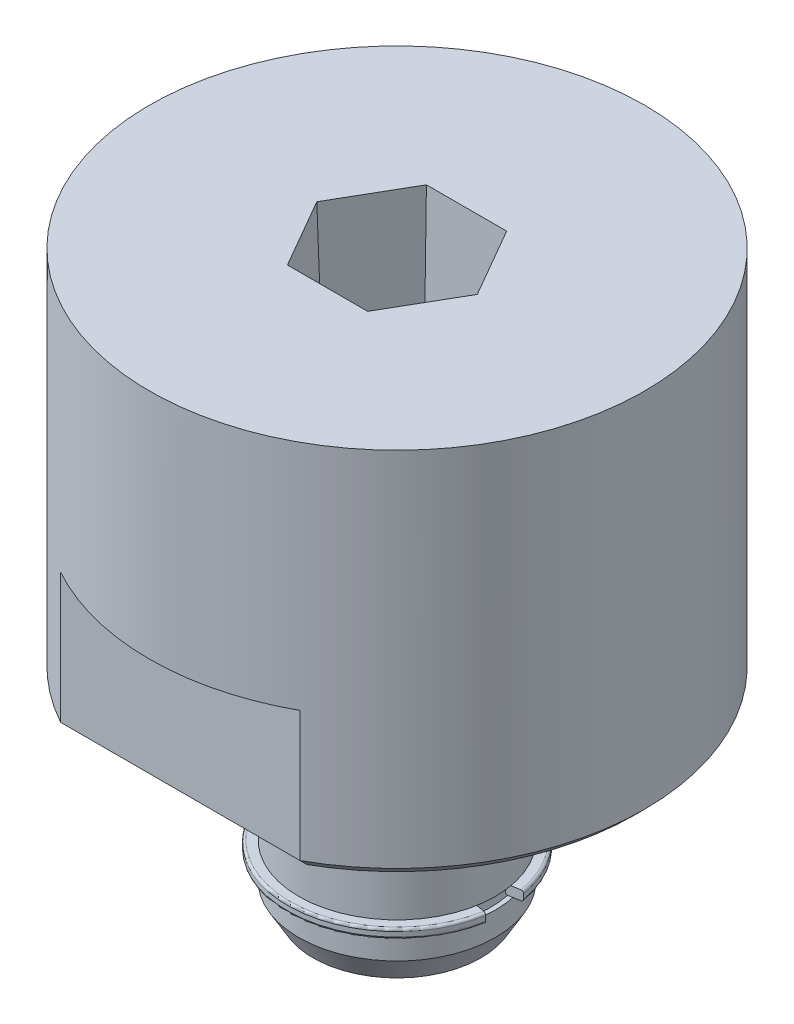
ISO-10303-21;
HEADER;
FILE_DESCRIPTION(('STEP AP214'),'2;1');
FILE_NAME('part.step','',(''),(''),'','','');
FILE_SCHEMA(('AUTOMOTIVE_DESIGN { 1 0 10303 214 1 1 1 1 }'));
ENDSEC;
DATA;
#1=APPLICATION_CONTEXT('core data for automotive mechanical design processes');
#2=APPLICATION_PROTOCOL_DEFINITION('international standard','automotive_design',2000,#1);
#3=PRODUCT_CONTEXT('',#1,'mechanical');
#4=PRODUCT('Part','Part','',(#3));
#5=PRODUCT_RELATED_PRODUCT_CATEGORY('part','',(#4));
#6=PRODUCT_DEFINITION_FORMATION('','',#4);
#7=PRODUCT_DEFINITION_CONTEXT('part definition',#1,'design');
#8=PRODUCT_DEFINITION('design','',#6,#7);
#9=PRODUCT_DEFINITION_SHAPE('','',#8);
#10=(LENGTH_UNIT() NAMED_UNIT(*) SI_UNIT(.MILLI.,.METRE.));
#11=(NAMED_UNIT(*) PLANE_ANGLE_UNIT() SI_UNIT($,.RADIAN.));
#12=(NAMED_UNIT(*) SI_UNIT($,.STERADIAN.) SOLID_ANGLE_UNIT());
#13=UNCERTAINTY_MEASURE_WITH_UNIT(LENGTH_MEASURE(1.E-05),#10,'distance_accuracy_value','');
#14=(GEOMETRIC_REPRESENTATION_CONTEXT(3) GLOBAL_UNCERTAINTY_ASSIGNED_CONTEXT((#13)) GLOBAL_UNIT_ASSIGNED_CONTEXT((#10,
#11,#12)) REPRESENTATION_CONTEXT('',''));
#15=CARTESIAN_POINT('',(0.,0.,0.));
#16=DIRECTION('',(0.,0.,1.));
#17=DIRECTION('',(1.,0.,0.));
#18=AXIS2_PLACEMENT_3D('',#15,#16,#17);
#19=CARTESIAN_POINT('',(0.,0.527599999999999,0.));
#20=DIRECTION('',(0.,-1.,0.));
#21=DIRECTION('',(0.,0.,-1.));
#22=AXIS2_PLACEMENT_3D('',#19,#20,#21);
#23=CYLINDRICAL_SURFACE('',#22,3.0226);
#24=CARTESIAN_POINT('',(0.,1.7214,0.));
#25=DIRECTION('',(0.,-1.,0.));
#26=DIRECTION('',(0.984807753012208,0.,0.17364817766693));
#27=AXIS2_PLACEMENT_3D('',#24,#25,#26);
#28=CIRCLE('',#27,3.0226);
#29=CARTESIAN_POINT('',(2.9766799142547,1.7214,0.524868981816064));
#30=VERTEX_POINT('',#29);
#31=CARTESIAN_POINT('',(2.9766799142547,1.7214,-0.524868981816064));
#32=VERTEX_POINT('',#31);
#33=EDGE_CURVE('E125',#30,#32,#28,.T.);
#34=ORIENTED_EDGE('',*,*,#33,.T.);
#35=DIRECTION('',(0.,1.,0.));
#36=VECTOR('',#35,1.);
#37=CARTESIAN_POINT('',(2.9766799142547,1.7214,-0.524868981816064));
#38=LINE('',#37,#36);
#39=CARTESIAN_POINT('',(2.9766799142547,1.8738,-0.524868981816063));
#40=VERTEX_POINT('',#39);
#41=EDGE_CURVE('E116',#32,#40,#38,.T.);
#42=ORIENTED_EDGE('',*,*,#41,.T.);
#43=CARTESIAN_POINT('',(0.,1.8738,0.));
#44=DIRECTION('',(0.,-1.,0.));
#45=DIRECTION('',(0.984807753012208,0.,0.17364817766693));
#46=AXIS2_PLACEMENT_3D('',#43,#44,#45);
#47=CIRCLE('',#46,3.0226);
#48=CARTESIAN_POINT('',(2.9766799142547,1.8738,0.524868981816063));
#49=VERTEX_POINT('',#48);
#50=EDGE_CURVE('E124',#49,#40,#47,.T.);
#51=ORIENTED_EDGE('',*,*,#50,.F.);
#52=DIRECTION('',(0.,-1.,0.));
#53=VECTOR('',#52,1.);
#54=CARTESIAN_POINT('',(2.9766799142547,1.8738,0.524868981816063));
#55=LINE('',#54,#53);
#56=EDGE_CURVE('E137',#49,#30,#55,.T.);
#57=ORIENTED_EDGE('',*,*,#56,.T.);
#58=EDGE_LOOP('',(#34,#42,#51,#57));
#59=FACE_BOUND('',#58,.T.);
#60=ADVANCED_FACE('F54',(#59),#23,.F.);
#61=CARTESIAN_POINT('',(0.,1.72139999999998,0.));
#62=DIRECTION('',(0.,-1.,0.));
#63=DIRECTION('',(0.,0.,-1.));
#64=AXIS2_PLACEMENT_3D('',#61,#62,#63);
#65=TOROIDAL_SURFACE('',#64,3.0988,0.0761999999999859);
#66=CARTESIAN_POINT('',(0.,1.6452,0.));
#67=DIRECTION('',(0.,-1.,0.));
#68=DIRECTION('',(0.984807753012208,0.,0.173648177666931));
#69=AXIS2_PLACEMENT_3D('',#66,#67,#68);
#70=CIRCLE('',#69,3.0988);
#71=CARTESIAN_POINT('',(3.05172226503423,1.6452,0.538100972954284));
#72=VERTEX_POINT('',#71);
#73=CARTESIAN_POINT('',(3.05172226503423,1.6452,-0.538100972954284));
#74=VERTEX_POINT('',#73);
#75=EDGE_CURVE('E133',#72,#74,#70,.T.);
#76=ORIENTED_EDGE('',*,*,#75,.T.);
#77=CARTESIAN_POINT('',(3.05172226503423,1.72139999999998,-0.538100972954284));
#78=DIRECTION('',(-0.17364817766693,0.,-0.984807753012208));
#79=DIRECTION('',(0.,-1.,0.));
#80=AXIS2_PLACEMENT_3D('',#77,#78,#79);
#81=CIRCLE('',#80,0.0761999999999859);
#82=EDGE_CURVE('E118',#74,#32,#81,.T.);
#83=ORIENTED_EDGE('',*,*,#82,.T.);
#84=ORIENTED_EDGE('',*,*,#33,.F.);
#85=CARTESIAN_POINT('',(3.05172226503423,1.72139999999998,0.538100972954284));
#86=DIRECTION('',(-0.17364817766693,0.,0.984807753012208));
#87=DIRECTION('',(-0.984807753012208,0.,-0.17364817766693));
#88=AXIS2_PLACEMENT_3D('',#85,#86,#87);
#89=CIRCLE('',#88,0.0761999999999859);
#90=EDGE_CURVE('E134',#30,#72,#89,.T.);
#91=ORIENTED_EDGE('',*,*,#90,.T.);
#92=EDGE_LOOP('',(#76,#83,#84,#91));
#93=FACE_BOUND('',#92,.T.);
#94=ADVANCED_FACE('F130',(#93),#65,.T.);
#95=CARTESIAN_POINT('',(3.0988,1.6452,0.));
#96=DIRECTION('',(0.,-1.,0.));
#97=DIRECTION('',(0.,0.,-1.));
#98=AXIS2_PLACEMENT_3D('',#95,#96,#97);
#99=PLANE('',#98);
#100=CARTESIAN_POINT('',(0.,1.6452,0.));
#101=DIRECTION('',(0.,-1.,0.));
#102=DIRECTION('',(0.984807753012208,0.,0.17364817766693));
#103=AXIS2_PLACEMENT_3D('',#100,#101,#102);
#104=CIRCLE('',#103,3.45439999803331);
#105=CARTESIAN_POINT('',(3.40191990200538,1.6452,0.599850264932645));
#106=VERTEX_POINT('',#105);
#107=CARTESIAN_POINT('',(3.40191990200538,1.6452,-0.599850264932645));
#108=VERTEX_POINT('',#107);
#109=EDGE_CURVE('E156',#106,#108,#104,.T.);
#110=ORIENTED_EDGE('',*,*,#109,.T.);
#111=DIRECTION('',(-0.984807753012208,0.,0.17364817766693));
#112=VECTOR('',#111,1.);
#113=CARTESIAN_POINT('',(3.40191990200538,1.6452,-0.599850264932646));
#114=LINE('',#113,#112);
#115=EDGE_CURVE('E161',#108,#74,#114,.T.);
#116=ORIENTED_EDGE('',*,*,#115,.T.);
#117=ORIENTED_EDGE('',*,*,#75,.F.);
#118=DIRECTION('',(0.984807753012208,0.,0.17364817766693));
#119=VECTOR('',#118,1.);
#120=CARTESIAN_POINT('',(3.05172226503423,1.6452,0.538100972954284));
#121=LINE('',#120,#119);
#122=EDGE_CURVE('E165',#72,#106,#121,.T.);
#123=ORIENTED_EDGE('',*,*,#122,.T.);
#124=EDGE_LOOP('',(#110,#116,#117,#123));
#125=FACE_BOUND('',#124,.T.);
#126=ADVANCED_FACE('F248',(#125),#99,.T.);
#127=CARTESIAN_POINT('',(0.,1.72139999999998,0.));
#128=DIRECTION('',(0.,-1.,0.));
#129=DIRECTION('',(0.,0.,-1.));
#130=AXIS2_PLACEMENT_3D('',#127,#128,#129);
#131=TOROIDAL_SURFACE('',#130,3.4544,0.0761999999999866);
#132=CARTESIAN_POINT('',(0.,1.7214,0.));
#133=DIRECTION('',(0.,-1.,0.));
#134=DIRECTION('',(0.984807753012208,0.,0.17364817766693));
#135=AXIS2_PLACEMENT_3D('',#132,#133,#134);
#136=CIRCLE('',#135,3.5306);
#137=CARTESIAN_POINT('',(3.4769622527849,1.7214,0.613082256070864));
#138=VERTEX_POINT('',#137);
#139=CARTESIAN_POINT('',(3.4769622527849,1.7214,-0.613082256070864));
#140=VERTEX_POINT('',#139);
#141=EDGE_CURVE('E170',#138,#140,#136,.T.);
#142=ORIENTED_EDGE('',*,*,#141,.T.);
#143=CARTESIAN_POINT('',(3.40191990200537,1.72139999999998,-0.599850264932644));
#144=DIRECTION('',(-0.17364817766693,0.,-0.984807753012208));
#145=DIRECTION('',(0.984807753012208,0.,-0.17364817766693));
#146=AXIS2_PLACEMENT_3D('',#143,#144,#145);
#147=CIRCLE('',#146,0.0761999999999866);
#148=EDGE_CURVE('E175',#140,#108,#147,.T.);
#149=ORIENTED_EDGE('',*,*,#148,.T.);
#150=ORIENTED_EDGE('',*,*,#109,.F.);
#151=CARTESIAN_POINT('',(3.40191990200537,1.72139999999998,0.599850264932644));
#152=DIRECTION('',(-0.17364817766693,0.,0.984807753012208));
#153=DIRECTION('',(1.10880188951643E-13,-1.,0.));
#154=AXIS2_PLACEMENT_3D('',#151,#152,#153);
#155=CIRCLE('',#154,0.0761999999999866);
#156=EDGE_CURVE('E180',#106,#138,#155,.T.);
#157=ORIENTED_EDGE('',*,*,#156,.T.);
#158=EDGE_LOOP('',(#142,#149,#150,#157));
#159=FACE_BOUND('',#158,.T.);
#160=ADVANCED_FACE('F246',(#159),#131,.T.);
#161=CARTESIAN_POINT('',(0.,0.527599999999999,0.));
#162=DIRECTION('',(0.,-1.,0.));
#163=DIRECTION('',(0.,0.,-1.));
#164=AXIS2_PLACEMENT_3D('',#161,#162,#163);
#165=CYLINDRICAL_SURFACE('',#164,3.5306);
#166=CARTESIAN_POINT('',(0.,1.8738,0.));
#167=DIRECTION('',(0.,-1.,0.));
#168=DIRECTION('',(0.984807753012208,0.,0.17364817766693));
#169=AXIS2_PLACEMENT_3D('',#166,#167,#168);
#170=CIRCLE('',#169,3.5306);
#171=CARTESIAN_POINT('',(3.4769622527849,1.8738,0.613082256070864));
#172=VERTEX_POINT('',#171);
#173=CARTESIAN_POINT('',(3.4769622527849,1.8738,-0.613082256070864));
#174=VERTEX_POINT('',#173);
#175=EDGE_CURVE('E185',#172,#174,#170,.T.);
#176=ORIENTED_EDGE('',*,*,#175,.T.);
#177=DIRECTION('',(0.,-1.,0.));
#178=VECTOR('',#177,1.);
#179=CARTESIAN_POINT('',(3.4769622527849,1.8738,-0.613082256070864));
#180=LINE('',#179,#178);
#181=EDGE_CURVE('E190',#174,#140,#180,.T.);
#182=ORIENTED_EDGE('',*,*,#181,.T.);
#183=ORIENTED_EDGE('',*,*,#141,.F.);
#184=DIRECTION('',(0.,1.,0.));
#185=VECTOR('',#184,1.);
#186=CARTESIAN_POINT('',(3.4769622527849,1.7214,0.613082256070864));
#187=LINE('',#186,#185);
#188=EDGE_CURVE('E195',#138,#172,#187,.T.);
#189=ORIENTED_EDGE('',*,*,#188,.T.);
#190=EDGE_LOOP('',(#176,#182,#183,#189));
#191=FACE_BOUND('',#190,.T.);
#192=ADVANCED_FACE('F242',(#191),#165,.T.);
#193=CARTESIAN_POINT('',(0.,1.87380000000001,0.));
#194=DIRECTION('',(0.,-1.,0.));
#195=DIRECTION('',(0.,0.,-1.));
#196=AXIS2_PLACEMENT_3D('',#193,#194,#195);
#197=TOROIDAL_SURFACE('',#196,3.4544,0.0761999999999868);
#198=CARTESIAN_POINT('',(0.,1.95,0.));
#199=DIRECTION('',(0.,-1.,0.));
#200=DIRECTION('',(0.984807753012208,0.,0.17364817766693));
#201=AXIS2_PLACEMENT_3D('',#198,#199,#200);
#202=CIRCLE('',#201,3.45439999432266);
#203=CARTESIAN_POINT('',(3.40191990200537,1.95,0.599850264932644));
#204=VERTEX_POINT('',#203);
#205=CARTESIAN_POINT('',(3.40191990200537,1.95,-0.599850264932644));
#206=VERTEX_POINT('',#205);
#207=EDGE_CURVE('E200',#204,#206,#202,.T.);
#208=ORIENTED_EDGE('',*,*,#207,.T.);
#209=CARTESIAN_POINT('',(3.40191990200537,1.87380000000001,-0.599850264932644));
#210=DIRECTION('',(-0.17364817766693,0.,-0.984807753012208));
#211=DIRECTION('',(0.,1.,0.));
#212=AXIS2_PLACEMENT_3D('',#209,#210,#211);
#213=CIRCLE('',#212,0.0761999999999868);
#214=EDGE_CURVE('E205',#206,#174,#213,.T.);
#215=ORIENTED_EDGE('',*,*,#214,.T.);
#216=ORIENTED_EDGE('',*,*,#175,.F.);
#217=CARTESIAN_POINT('',(3.40191990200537,1.87380000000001,0.599850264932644));
#218=DIRECTION('',(-0.17364817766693,0.,0.984807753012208));
#219=DIRECTION('',(0.984807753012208,-1.75931010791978E-13,0.17364817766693));
#220=AXIS2_PLACEMENT_3D('',#217,#218,#219);
#221=CIRCLE('',#220,0.0761999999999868);
#222=EDGE_CURVE('E210',#172,#204,#221,.T.);
#223=ORIENTED_EDGE('',*,*,#222,.T.);
#224=EDGE_LOOP('',(#208,#215,#216,#223));
#225=FACE_BOUND('',#224,.T.);
#226=ADVANCED_FACE('F240',(#225),#197,.T.);
#227=CARTESIAN_POINT('',(3.4544,1.95,0.));
#228=DIRECTION('',(0.,1.,0.));
#229=DIRECTION('',(0.,0.,1.));
#230=AXIS2_PLACEMENT_3D('',#227,#228,#229);
#231=PLANE('',#230);
#232=CARTESIAN_POINT('',(0.,1.95,0.));
#233=DIRECTION('',(0.,-1.,0.));
#234=DIRECTION('',(0.984807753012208,0.,0.17364817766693));
#235=AXIS2_PLACEMENT_3D('',#232,#233,#234);
#236=CIRCLE('',#235,3.09879999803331);
#237=CARTESIAN_POINT('',(3.05172226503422,1.95,0.538100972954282));
#238=VERTEX_POINT('',#237);
#239=CARTESIAN_POINT('',(3.05172226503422,1.95,-0.538100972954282));
#240=VERTEX_POINT('',#239);
#241=EDGE_CURVE('E215',#238,#240,#236,.T.);
#242=ORIENTED_EDGE('',*,*,#241,.T.);
#243=DIRECTION('',(0.984807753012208,0.,-0.173648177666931));
#244=VECTOR('',#243,1.);
#245=CARTESIAN_POINT('',(3.05172226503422,1.95,-0.538100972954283));
#246=LINE('',#245,#244);
#247=EDGE_CURVE('E76',#240,#206,#246,.T.);
#248=ORIENTED_EDGE('',*,*,#247,.T.);
#249=ORIENTED_EDGE('',*,*,#207,.F.);
#250=DIRECTION('',(-0.984807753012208,0.,-0.173648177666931));
#251=VECTOR('',#250,1.);
#252=CARTESIAN_POINT('',(3.40191990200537,1.95,0.599850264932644));
#253=LINE('',#252,#251);
#254=EDGE_CURVE('E223',#204,#238,#253,.T.);
#255=ORIENTED_EDGE('',*,*,#254,.T.);
#256=EDGE_LOOP('',(#242,#248,#249,#255));
#257=FACE_BOUND('',#256,.T.);
#258=ADVANCED_FACE('F235',(#257),#231,.T.);
#259=CARTESIAN_POINT('',(0.,1.87380000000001,0.));
#260=DIRECTION('',(0.,-1.,0.));
#261=DIRECTION('',(0.,0.,-1.));
#262=AXIS2_PLACEMENT_3D('',#259,#260,#261);
#263=TOROIDAL_SURFACE('',#262,3.0988,0.0761999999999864);
#264=ORIENTED_EDGE('',*,*,#50,.T.);
#265=CARTESIAN_POINT('',(3.05172226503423,1.87380000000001,-0.538100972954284));
#266=DIRECTION('',(-0.17364817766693,0.,-0.984807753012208));
#267=DIRECTION('',(-0.984807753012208,-1.78662858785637E-13,0.17364817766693));
#268=AXIS2_PLACEMENT_3D('',#265,#266,#267);
#269=CIRCLE('',#268,0.0761999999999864);
#270=EDGE_CURVE('E63',#40,#240,#269,.T.);
#271=ORIENTED_EDGE('',*,*,#270,.T.);
#272=ORIENTED_EDGE('',*,*,#241,.F.);
#273=CARTESIAN_POINT('',(3.05172226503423,1.87380000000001,0.538100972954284));
#274=DIRECTION('',(-0.17364817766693,0.,0.984807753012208));
#275=DIRECTION('',(0.,1.,0.));
#276=AXIS2_PLACEMENT_3D('',#273,#274,#275);
#277=CIRCLE('',#276,0.0761999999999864);
#278=EDGE_CURVE('E12',#238,#49,#277,.T.);
#279=ORIENTED_EDGE('',*,*,#278,.T.);
#280=EDGE_LOOP('',(#264,#271,#272,#279));
#281=FACE_BOUND('',#280,.T.);
#282=ADVANCED_FACE('F233',(#281),#263,.T.);
#283=CARTESIAN_POINT('',(0.,2.1024,0.));
#284=DIRECTION('',(0.17364817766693,0.,-0.984807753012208));
#285=DIRECTION('',(-0.984807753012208,0.,-0.17364817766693));
#286=AXIS2_PLACEMENT_3D('',#283,#284,#285);
#287=PLANE('',#286);
#288=ORIENTED_EDGE('',*,*,#278,.F.);
#289=ORIENTED_EDGE('',*,*,#254,.F.);
#290=ORIENTED_EDGE('',*,*,#222,.F.);
#291=ORIENTED_EDGE('',*,*,#188,.F.);
#292=ORIENTED_EDGE('',*,*,#156,.F.);
#293=ORIENTED_EDGE('',*,*,#122,.F.);
#294=ORIENTED_EDGE('',*,*,#90,.F.);
#295=ORIENTED_EDGE('',*,*,#56,.F.);
#296=EDGE_LOOP('',(#288,#289,#290,#291,#292,#293,#294,#295));
#297=FACE_BOUND('',#296,.T.);
#298=ADVANCED_FACE('F237',(#297),#287,.T.);
#299=CARTESIAN_POINT('',(3.54950319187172,2.1024,-0.6258731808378));
#300=DIRECTION('',(0.17364817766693,0.,0.984807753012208));
#301=DIRECTION('',(0.984807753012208,0.,-0.17364817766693));
#302=AXIS2_PLACEMENT_3D('',#299,#300,#301);
#303=PLANE('',#302);
#304=ORIENTED_EDGE('',*,*,#82,.F.);
#305=ORIENTED_EDGE('',*,*,#115,.F.);
#306=ORIENTED_EDGE('',*,*,#148,.F.);
#307=ORIENTED_EDGE('',*,*,#181,.F.);
#308=ORIENTED_EDGE('',*,*,#214,.F.);
#309=ORIENTED_EDGE('',*,*,#247,.F.);
#310=ORIENTED_EDGE('',*,*,#270,.F.);
#311=ORIENTED_EDGE('',*,*,#41,.F.);
#312=EDGE_LOOP('',(#304,#305,#306,#307,#308,#309,#310,#311));
#313=FACE_BOUND('',#312,.T.);
#314=ADVANCED_FACE('F56',(#313),#303,.T.);
#315=CLOSED_SHELL('',(#60,#94,#126,#160,#192,#226,#258,#282,#298,#314));
#316=MANIFOLD_SOLID_BREP('B2',#315);
#317=CARTESIAN_POINT('',(7.9975,18.5,0.));
#318=DIRECTION('',(0.,1.,0.));
#319=DIRECTION('',(0.,0.,1.));
#320=AXIS2_PLACEMENT_3D('',#317,#318,#319);
#321=PLANE('',#320);
#322=DIRECTION('',(1.,0.,0.));
#323=VECTOR('',#322,1.);
#324=CARTESIAN_POINT('',(7.9975,18.5,-2.24444538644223));
#325=LINE('',#324,#323);
#326=CARTESIAN_POINT('',(1.29583114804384,18.5,-2.24444538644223));
#327=VERTEX_POINT('',#326);
#328=CARTESIAN_POINT('',(-1.29583114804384,18.5,-2.24444538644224));
#329=VERTEX_POINT('',#328);
#330=EDGE_CURVE('E414',#327,#329,#325,.F.);
#331=ORIENTED_EDGE('',*,*,#330,.F.);
#332=DIRECTION('',(0.5,0.,0.866025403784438));
#333=VECTOR('',#332,1.);
#334=CARTESIAN_POINT('',(3.94312172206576,18.5,2.34079639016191));
#335=LINE('',#334,#333);
#336=CARTESIAN_POINT('',(2.59166229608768,18.5,0.));
#337=VERTEX_POINT('',#336);
#338=EDGE_CURVE('E424',#337,#327,#335,.F.);
#339=ORIENTED_EDGE('',*,*,#338,.F.);
#340=DIRECTION('',(-0.5,0.,0.866025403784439));
#341=VECTOR('',#340,1.);
#342=CARTESIAN_POINT('',(3.94312172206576,18.5,-2.34079639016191));
#343=LINE('',#342,#341);
#344=CARTESIAN_POINT('',(1.29583114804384,18.5,2.24444538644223));
#345=VERTEX_POINT('',#344);
#346=EDGE_CURVE('E419',#345,#337,#343,.F.);
#347=ORIENTED_EDGE('',*,*,#346,.F.);
#348=DIRECTION('',(-1.,0.,0.));
#349=VECTOR('',#348,1.);
#350=CARTESIAN_POINT('',(7.9975,18.5,2.24444538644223));
#351=LINE('',#350,#349);
#352=CARTESIAN_POINT('',(-1.29583114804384,18.5,2.24444538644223));
#353=VERTEX_POINT('',#352);
#354=EDGE_CURVE('E418',#353,#345,#351,.F.);
#355=ORIENTED_EDGE('',*,*,#354,.F.);
#356=DIRECTION('',(-0.5,0.,-0.866025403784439));
#357=VECTOR('',#356,1.);
#358=CARTESIAN_POINT('',(0.0556282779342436,18.5,4.58524177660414));
#359=LINE('',#358,#357);
#360=CARTESIAN_POINT('',(-2.59166229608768,18.5,0.));
#361=VERTEX_POINT('',#360);
#362=EDGE_CURVE('E397',#361,#353,#359,.F.);
#363=ORIENTED_EDGE('',*,*,#362,.F.);
#364=DIRECTION('',(0.5,0.,-0.866025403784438));
#365=VECTOR('',#364,1.);
#366=CARTESIAN_POINT('',(0.0556282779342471,18.5,-4.58524177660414));
#367=LINE('',#366,#365);
#368=EDGE_CURVE('E354',#329,#361,#367,.F.);
#369=ORIENTED_EDGE('',*,*,#368,.F.);
#370=EDGE_LOOP('',(#331,#339,#347,#355,#363,#369));
#371=FACE_BOUND('',#370,.T.);
#372=CARTESIAN_POINT('',(0.,18.5,0.));
#373=DIRECTION('',(0.,-1.,0.));
#374=DIRECTION('',(0.,0.,-1.));
#375=AXIS2_PLACEMENT_3D('',#372,#373,#374);
#376=CIRCLE('',#375,7.9975);
#377=CARTESIAN_POINT('',(0.,18.5,-7.9975));
#378=VERTEX_POINT('',#377);
#379=EDGE_CURVE('E677',#378,#378,#376,.T.);
#380=ORIENTED_EDGE('',*,*,#379,.F.);
#381=EDGE_LOOP('',(#380));
#382=FACE_BOUND('',#381,.T.);
#383=ADVANCED_FACE('F350',(#371,#382),#321,.T.);
#384=CARTESIAN_POINT('',(0.,0.,0.));
#385=DIRECTION('',(0.,-1.,0.));
#386=DIRECTION('',(0.,0.,-1.));
#387=AXIS2_PLACEMENT_3D('',#384,#385,#386);
#388=CYLINDRICAL_SURFACE('',#387,7.9975);
#389=DIRECTION('',(0.,-1.,0.));
#390=VECTOR('',#389,1.);
#391=CARTESIAN_POINT('',(3.86781672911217,11.,7.));
#392=LINE('',#391,#390);
#393=CARTESIAN_POINT('',(3.86781672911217,11.,7.));
#394=VERTEX_POINT('',#393);
#395=CARTESIAN_POINT('',(3.86781672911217,6.8,7.));
#396=VERTEX_POINT('',#395);
#397=EDGE_CURVE('E438',#394,#396,#392,.T.);
#398=ORIENTED_EDGE('',*,*,#397,.T.);
#399=CARTESIAN_POINT('',(0.,6.8,0.));
#400=DIRECTION('',(0.,-1.,0.));
#401=DIRECTION('',(0.,0.,-1.));
#402=AXIS2_PLACEMENT_3D('',#399,#400,#401);
#403=CIRCLE('',#402,7.9975);
#404=CARTESIAN_POINT('',(3.86781672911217,6.8,-7.));
#405=VERTEX_POINT('',#404);
#406=EDGE_CURVE('E360',#396,#405,#403,.F.);
#407=ORIENTED_EDGE('',*,*,#406,.T.);
#408=DIRECTION('',(0.,-1.,0.));
#409=VECTOR('',#408,1.);
#410=CARTESIAN_POINT('',(3.86781672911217,11.,-7.));
#411=LINE('',#410,#409);
#412=CARTESIAN_POINT('',(3.86781672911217,11.,-7.));
#413=VERTEX_POINT('',#412);
#414=EDGE_CURVE('E639',#413,#405,#411,.T.);
#415=ORIENTED_EDGE('',*,*,#414,.F.);
#416=CARTESIAN_POINT('',(0.,11.,0.));
#417=DIRECTION('',(0.,-1.,0.));
#418=DIRECTION('',(0.,0.,-1.));
#419=AXIS2_PLACEMENT_3D('',#416,#417,#418);
#420=CIRCLE('',#419,7.9975);
#421=CARTESIAN_POINT('',(-3.86781672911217,11.,-7.));
#422=VERTEX_POINT('',#421);
#423=EDGE_CURVE('E632',#422,#413,#420,.T.);
#424=ORIENTED_EDGE('',*,*,#423,.F.);
#425=DIRECTION('',(0.,-1.,0.));
#426=VECTOR('',#425,1.);
#427=CARTESIAN_POINT('',(-3.86781672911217,11.,-7.));
#428=LINE('',#427,#426);
#429=CARTESIAN_POINT('',(-3.86781672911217,6.8,-7.));
#430=VERTEX_POINT('',#429);
#431=EDGE_CURVE('E640',#422,#430,#428,.T.);
#432=ORIENTED_EDGE('',*,*,#431,.T.);
#433=CARTESIAN_POINT('',(0.,6.8,0.));
#434=DIRECTION('',(0.,-1.,0.));
#435=DIRECTION('',(0.,0.,-1.));
#436=AXIS2_PLACEMENT_3D('',#433,#434,#435);
#437=CIRCLE('',#436,7.9975);
#438=CARTESIAN_POINT('',(-3.86781672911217,6.8,7.));
#439=VERTEX_POINT('',#438);
#440=EDGE_CURVE('E695',#430,#439,#437,.F.);
#441=ORIENTED_EDGE('',*,*,#440,.T.);
#442=DIRECTION('',(0.,-1.,0.));
#443=VECTOR('',#442,1.);
#444=CARTESIAN_POINT('',(-3.86781672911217,11.,7.));
#445=LINE('',#444,#443);
#446=CARTESIAN_POINT('',(-3.86781672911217,11.,7.));
#447=VERTEX_POINT('',#446);
#448=EDGE_CURVE('E646',#447,#439,#445,.T.);
#449=ORIENTED_EDGE('',*,*,#448,.F.);
#450=CARTESIAN_POINT('',(0.,11.,0.));
#451=DIRECTION('',(0.,-1.,0.));
#452=DIRECTION('',(0.,0.,-1.));
#453=AXIS2_PLACEMENT_3D('',#450,#451,#452);
#454=CIRCLE('',#453,7.9975);
#455=EDGE_CURVE('E636',#394,#447,#454,.T.);
#456=ORIENTED_EDGE('',*,*,#455,.F.);
#457=EDGE_LOOP('',(#398,#407,#415,#424,#432,#441,#449,#456));
#458=FACE_BOUND('',#457,.T.);
#459=ORIENTED_EDGE('',*,*,#379,.T.);
#460=EDGE_LOOP('',(#459));
#461=FACE_BOUND('',#460,.T.);
#462=ADVANCED_FACE('F499',(#458,#461),#388,.T.);
#463=CARTESIAN_POINT('',(3.675,6.5,0.));
#464=DIRECTION('',(0.,-1.,0.));
#465=DIRECTION('',(0.,0.,-1.));
#466=AXIS2_PLACEMENT_3D('',#463,#464,#465);
#467=PLANE('',#466);
#468=CARTESIAN_POINT('',(0.,6.5,0.));
#469=DIRECTION('',(0.,-1.,0.));
#470=DIRECTION('',(0.,0.,-1.));
#471=AXIS2_PLACEMENT_3D('',#468,#469,#470);
#472=CIRCLE('',#471,7.6975);
#473=CARTESIAN_POINT('',(-3.78965780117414,6.5,6.7));
#474=VERTEX_POINT('',#473);
#475=CARTESIAN_POINT('',(-3.78965780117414,6.5,-6.7));
#476=VERTEX_POINT('',#475);
#477=EDGE_CURVE('E683',#474,#476,#472,.T.);
#478=ORIENTED_EDGE('',*,*,#477,.T.);
#479=DIRECTION('',(1.,0.,0.));
#480=VECTOR('',#479,1.);
#481=CARTESIAN_POINT('',(3.86781672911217,6.5,-6.7));
#482=LINE('',#481,#480);
#483=CARTESIAN_POINT('',(3.78965780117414,6.5,-6.7));
#484=VERTEX_POINT('',#483);
#485=EDGE_CURVE('E692',#476,#484,#482,.T.);
#486=ORIENTED_EDGE('',*,*,#485,.T.);
#487=CARTESIAN_POINT('',(0.,6.5,0.));
#488=DIRECTION('',(0.,-1.,0.));
#489=DIRECTION('',(0.,0.,-1.));
#490=AXIS2_PLACEMENT_3D('',#487,#488,#489);
#491=CIRCLE('',#490,7.6975);
#492=CARTESIAN_POINT('',(3.78965780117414,6.5,6.7));
#493=VERTEX_POINT('',#492);
#494=EDGE_CURVE('E689',#484,#493,#491,.T.);
#495=ORIENTED_EDGE('',*,*,#494,.T.);
#496=DIRECTION('',(-1.,0.,0.));
#497=VECTOR('',#496,1.);
#498=CARTESIAN_POINT('',(-3.86781672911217,6.5,6.7));
#499=LINE('',#498,#497);
#500=EDGE_CURVE('E686',#493,#474,#499,.T.);
#501=ORIENTED_EDGE('',*,*,#500,.T.);
#502=EDGE_LOOP('',(#478,#486,#495,#501));
#503=FACE_BOUND('',#502,.T.);
#504=CARTESIAN_POINT('',(4.0658639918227,6.5,-4.0658639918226));
#505=DIRECTION('',(0.,-1.,0.));
#506=DIRECTION('',(-0.707106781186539,0.,-0.707106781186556));
#507=AXIS2_PLACEMENT_3D('',#504,#505,#506);
#508=CIRCLE('',#507,0.559016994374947);
#509=CARTESIAN_POINT('',(3.67057928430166,6.5,-4.46114869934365));
#510=VERTEX_POINT('',#509);
#511=EDGE_CURVE('E450',#510,#510,#508,.T.);
#512=ORIENTED_EDGE('',*,*,#511,.F.);
#513=EDGE_LOOP('',(#512));
#514=FACE_BOUND('',#513,.T.);
#515=CARTESIAN_POINT('',(0.,6.5,-5.75));
#516=DIRECTION('',(0.,-1.,0.));
#517=DIRECTION('',(-1.,0.,0.));
#518=AXIS2_PLACEMENT_3D('',#515,#516,#517);
#519=CIRCLE('',#518,0.559016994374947);
#520=CARTESIAN_POINT('',(-0.559016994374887,6.5,-5.75000000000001));
#521=VERTEX_POINT('',#520);
#522=EDGE_CURVE('E597',#521,#521,#519,.T.);
#523=ORIENTED_EDGE('',*,*,#522,.F.);
#524=EDGE_LOOP('',(#523));
#525=FACE_BOUND('',#524,.T.);
#526=CARTESIAN_POINT('',(-4.06586399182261,6.5,-4.06586399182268));
#527=DIRECTION('',(0.,-1.,0.));
#528=DIRECTION('',(-0.707106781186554,0.,0.707106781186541));
#529=AXIS2_PLACEMENT_3D('',#526,#527,#528);
#530=CIRCLE('',#529,0.559016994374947);
#531=CARTESIAN_POINT('',(-4.46114869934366,6.5,-3.67057928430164));
#532=VERTEX_POINT('',#531);
#533=EDGE_CURVE('E600',#532,#532,#530,.T.);
#534=ORIENTED_EDGE('',*,*,#533,.F.);
#535=EDGE_LOOP('',(#534));
#536=FACE_BOUND('',#535,.T.);
#537=CARTESIAN_POINT('',(-5.75,6.5,0.));
#538=DIRECTION('',(0.,-1.,0.));
#539=DIRECTION('',(0.,0.,1.));
#540=AXIS2_PLACEMENT_3D('',#537,#538,#539);
#541=CIRCLE('',#540,0.559016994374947);
#542=CARTESIAN_POINT('',(-5.75,6.5,0.559016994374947));
#543=VERTEX_POINT('',#542);
#544=EDGE_CURVE('E605',#543,#543,#541,.T.);
#545=ORIENTED_EDGE('',*,*,#544,.F.);
#546=EDGE_LOOP('',(#545));
#547=FACE_BOUND('',#546,.T.);
#548=CARTESIAN_POINT('',(-4.06586399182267,6.5,4.06586399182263));
#549=DIRECTION('',(0.,-1.,0.));
#550=DIRECTION('',(0.707106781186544,0.,0.707106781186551));
#551=AXIS2_PLACEMENT_3D('',#548,#549,#550);
#552=CIRCLE('',#551,0.559016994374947);
#553=CARTESIAN_POINT('',(-3.67057928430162,6.5,4.46114869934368));
#554=VERTEX_POINT('',#553);
#555=EDGE_CURVE('E608',#554,#554,#552,.T.);
#556=ORIENTED_EDGE('',*,*,#555,.F.);
#557=EDGE_LOOP('',(#556));
#558=FACE_BOUND('',#557,.T.);
#559=CARTESIAN_POINT('',(0.,6.5,5.75));
#560=DIRECTION('',(0.,-1.,0.));
#561=DIRECTION('',(1.,0.,0.));
#562=AXIS2_PLACEMENT_3D('',#559,#560,#561);
#563=CIRCLE('',#562,0.559016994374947);
#564=CARTESIAN_POINT('',(0.559016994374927,6.5,5.75));
#565=VERTEX_POINT('',#564);
#566=EDGE_CURVE('E611',#565,#565,#563,.T.);
#567=ORIENTED_EDGE('',*,*,#566,.F.);
#568=EDGE_LOOP('',(#567));
#569=FACE_BOUND('',#568,.T.);
#570=CARTESIAN_POINT('',(4.06586399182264,6.5,4.06586399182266));
#571=DIRECTION('',(0.,-1.,0.));
#572=DIRECTION('',(0.707106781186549,0.,-0.707106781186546));
#573=AXIS2_PLACEMENT_3D('',#570,#571,#572);
#574=CIRCLE('',#573,0.559016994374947);
#575=CARTESIAN_POINT('',(4.46114869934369,6.5,3.67057928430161));
#576=VERTEX_POINT('',#575);
#577=EDGE_CURVE('E614',#576,#576,#574,.T.);
#578=ORIENTED_EDGE('',*,*,#577,.F.);
#579=EDGE_LOOP('',(#578));
#580=FACE_BOUND('',#579,.T.);
#581=CARTESIAN_POINT('',(5.75,6.5,0.));
#582=DIRECTION('',(0.,-1.,0.));
#583=DIRECTION('',(0.,0.,-1.));
#584=AXIS2_PLACEMENT_3D('',#581,#582,#583);
#585=CIRCLE('',#584,0.559016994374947);
#586=CARTESIAN_POINT('',(5.75,6.5,-0.559016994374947));
#587=VERTEX_POINT('',#586);
#588=EDGE_CURVE('E430',#587,#587,#585,.T.);
#589=ORIENTED_EDGE('',*,*,#588,.F.);
#590=EDGE_LOOP('',(#589));
#591=FACE_BOUND('',#590,.T.);
#592=CARTESIAN_POINT('',(0.,6.5,0.));
#593=DIRECTION('',(0.,-1.,0.));
#594=DIRECTION('',(0.,0.,-1.));
#595=AXIS2_PLACEMENT_3D('',#592,#593,#594);
#596=CIRCLE('',#595,3.675);
#597=CARTESIAN_POINT('',(0.,6.5,-3.675));
#598=VERTEX_POINT('',#597);
#599=EDGE_CURVE('E674',#598,#598,#596,.T.);
#600=ORIENTED_EDGE('',*,*,#599,.F.);
#601=EDGE_LOOP('',(#600));
#602=FACE_BOUND('',#601,.T.);
#603=ADVANCED_FACE('F502',(#503,#514,#525,#536,#547,#558,#569,#580,#591,#602),#467,.T.);
#604=CARTESIAN_POINT('',(0.,6.,0.));
#605=DIRECTION('',(0.,-1.,0.));
#606=DIRECTION('',(0.,0.,-1.));
#607=AXIS2_PLACEMENT_3D('',#604,#605,#606);
#608=TOROIDAL_SURFACE('',#607,3.675,0.5);
#609=ORIENTED_EDGE('',*,*,#599,.T.);
#610=EDGE_LOOP('',(#609));
#611=FACE_BOUND('',#610,.T.);
#612=CARTESIAN_POINT('',(0.,6.,0.));
#613=DIRECTION('',(0.,-1.,0.));
#614=DIRECTION('',(0.,0.,-1.));
#615=AXIS2_PLACEMENT_3D('',#612,#613,#614);
#616=CIRCLE('',#615,3.175);
#617=CARTESIAN_POINT('',(0.,6.,-3.175));
#618=VERTEX_POINT('',#617);
#619=EDGE_CURVE('E671',#618,#618,#616,.T.);
#620=ORIENTED_EDGE('',*,*,#619,.F.);
#621=EDGE_LOOP('',(#620));
#622=FACE_BOUND('',#621,.T.);
#623=ADVANCED_FACE('F506',(#611,#622),#608,.F.);
#624=CARTESIAN_POINT('',(0.,0.,0.));
#625=DIRECTION('',(0.,-1.,0.));
#626=DIRECTION('',(0.,0.,-1.));
#627=AXIS2_PLACEMENT_3D('',#624,#625,#626);
#628=CYLINDRICAL_SURFACE('',#627,3.175);
#629=ORIENTED_EDGE('',*,*,#619,.T.);
#630=EDGE_LOOP('',(#629));
#631=FACE_BOUND('',#630,.T.);
#632=CARTESIAN_POINT('',(0.,1.95,0.));
#633=DIRECTION('',(0.,-1.,0.));
#634=DIRECTION('',(0.,0.,-1.));
#635=AXIS2_PLACEMENT_3D('',#632,#633,#634);
#636=CIRCLE('',#635,3.175);
#637=CARTESIAN_POINT('',(0.,1.95,-3.175));
#638=VERTEX_POINT('',#637);
#639=EDGE_CURVE('E668',#638,#638,#636,.T.);
#640=ORIENTED_EDGE('',*,*,#639,.F.);
#641=EDGE_LOOP('',(#640));
#642=FACE_BOUND('',#641,.T.);
#643=ADVANCED_FACE('F510',(#631,#642),#628,.T.);
#644=CARTESIAN_POINT('',(3.025,1.95,0.));
#645=DIRECTION('',(0.,-1.,0.));
#646=DIRECTION('',(0.,0.,-1.));
#647=AXIS2_PLACEMENT_3D('',#644,#645,#646);
#648=PLANE('',#647);
#649=ORIENTED_EDGE('',*,*,#639,.T.);
#650=EDGE_LOOP('',(#649));
#651=FACE_BOUND('',#650,.T.);
#652=CARTESIAN_POINT('',(0.,1.95,0.));
#653=DIRECTION('',(0.,-1.,0.));
#654=DIRECTION('',(0.,0.,-1.));
#655=AXIS2_PLACEMENT_3D('',#652,#653,#654);
#656=CIRCLE('',#655,3.025);
#657=CARTESIAN_POINT('',(0.,1.95,-3.025));
#658=VERTEX_POINT('',#657);
#659=EDGE_CURVE('E665',#658,#658,#656,.T.);
#660=ORIENTED_EDGE('',*,*,#659,.F.);
#661=EDGE_LOOP('',(#660));
#662=FACE_BOUND('',#661,.T.);
#663=ADVANCED_FACE('F514',(#651,#662),#648,.T.);
#664=CARTESIAN_POINT('',(0.,0.,0.));
#665=DIRECTION('',(0.,-1.,0.));
#666=DIRECTION('',(0.,0.,-1.));
#667=AXIS2_PLACEMENT_3D('',#664,#665,#666);
#668=CYLINDRICAL_SURFACE('',#667,3.025);
#669=ORIENTED_EDGE('',*,*,#659,.T.);
#670=EDGE_LOOP('',(#669));
#671=FACE_BOUND('',#670,.T.);
#672=CARTESIAN_POINT('',(0.,1.57,0.));
#673=DIRECTION('',(0.,-1.,0.));
#674=DIRECTION('',(0.,0.,-1.));
#675=AXIS2_PLACEMENT_3D('',#672,#673,#674);
#676=CIRCLE('',#675,3.025);
#677=CARTESIAN_POINT('',(0.,1.57,-3.025));
#678=VERTEX_POINT('',#677);
#679=EDGE_CURVE('E662',#678,#678,#676,.T.);
#680=ORIENTED_EDGE('',*,*,#679,.F.);
#681=EDGE_LOOP('',(#680));
#682=FACE_BOUND('',#681,.T.);
#683=ADVANCED_FACE('F518',(#671,#682),#668,.T.);
#684=CARTESIAN_POINT('',(3.175,1.57,0.));
#685=DIRECTION('',(0.,1.,0.));
#686=DIRECTION('',(0.,0.,1.));
#687=AXIS2_PLACEMENT_3D('',#684,#685,#686);
#688=PLANE('',#687);
#689=ORIENTED_EDGE('',*,*,#679,.T.);
#690=EDGE_LOOP('',(#689));
#691=FACE_BOUND('',#690,.T.);
#692=CARTESIAN_POINT('',(0.,1.57,0.));
#693=DIRECTION('',(0.,-1.,0.));
#694=DIRECTION('',(0.,0.,-1.));
#695=AXIS2_PLACEMENT_3D('',#692,#693,#694);
#696=CIRCLE('',#695,3.175);
#697=CARTESIAN_POINT('',(0.,1.57,-3.175));
#698=VERTEX_POINT('',#697);
#699=EDGE_CURVE('E659',#698,#698,#696,.T.);
#700=ORIENTED_EDGE('',*,*,#699,.F.);
#701=EDGE_LOOP('',(#700));
#702=FACE_BOUND('',#701,.T.);
#703=ADVANCED_FACE('F522',(#691,#702),#688,.T.);
#704=CARTESIAN_POINT('',(0.,0.,0.));
#705=DIRECTION('',(0.,-1.,0.));
#706=DIRECTION('',(0.,0.,-1.));
#707=AXIS2_PLACEMENT_3D('',#704,#705,#706);
#708=CYLINDRICAL_SURFACE('',#707,3.175);
#709=ORIENTED_EDGE('',*,*,#699,.T.);
#710=EDGE_LOOP('',(#709));
#711=FACE_BOUND('',#710,.T.);
#712=CARTESIAN_POINT('',(0.,0.8,0.));
#713=DIRECTION('',(0.,-1.,0.));
#714=DIRECTION('',(0.,0.,-1.));
#715=AXIS2_PLACEMENT_3D('',#712,#713,#714);
#716=CIRCLE('',#715,3.175);
#717=CARTESIAN_POINT('',(0.,0.8,-3.175));
#718=VERTEX_POINT('',#717);
#719=EDGE_CURVE('E656',#718,#718,#716,.T.);
#720=ORIENTED_EDGE('',*,*,#719,.F.);
#721=EDGE_LOOP('',(#720));
#722=FACE_BOUND('',#721,.T.);
#723=ADVANCED_FACE('F526',(#711,#722),#708,.T.);
#724=CARTESIAN_POINT('',(0.,0.,0.));
#725=DIRECTION('',(0.,1.,0.));
#726=DIRECTION('',(0.,0.,1.));
#727=AXIS2_PLACEMENT_3D('',#724,#725,#726);
#728=CONICAL_SURFACE('',#727,2.71311978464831,0.523598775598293);
#729=ORIENTED_EDGE('',*,*,#719,.T.);
#730=EDGE_LOOP('',(#729));
#731=FACE_BOUND('',#730,.T.);
#732=CARTESIAN_POINT('',(0.,0.,0.));
#733=DIRECTION('',(0.,-1.,0.));
#734=DIRECTION('',(0.,0.,-1.));
#735=AXIS2_PLACEMENT_3D('',#732,#733,#734);
#736=CIRCLE('',#735,2.71311978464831);
#737=CARTESIAN_POINT('',(0.,0.,-2.71311978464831));
#738=VERTEX_POINT('',#737);
#739=EDGE_CURVE('E643',#738,#738,#736,.T.);
#740=ORIENTED_EDGE('',*,*,#739,.F.);
#741=EDGE_LOOP('',(#740));
#742=FACE_BOUND('',#741,.T.);
#743=ADVANCED_FACE('F530',(#731,#742),#728,.T.);
#744=CARTESIAN_POINT('',(0.,0.,0.));
#745=DIRECTION('',(0.,-1.,0.));
#746=DIRECTION('',(0.,0.,-1.));
#747=AXIS2_PLACEMENT_3D('',#744,#745,#746);
#748=PLANE('',#747);
#749=ORIENTED_EDGE('',*,*,#739,.T.);
#750=EDGE_LOOP('',(#749));
#751=FACE_BOUND('',#750,.T.);
#752=ADVANCED_FACE('F534',(#751),#748,.T.);
#753=CARTESIAN_POINT('',(-3.86781672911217,11.,7.));
#754=DIRECTION('',(0.,0.,-1.));
#755=DIRECTION('',(-1.,0.,0.));
#756=AXIS2_PLACEMENT_3D('',#753,#754,#755);
#757=PLANE('',#756);
#758=ORIENTED_EDGE('',*,*,#448,.T.);
#759=DIRECTION('',(1.,0.,0.));
#760=VECTOR('',#759,1.);
#761=CARTESIAN_POINT('',(3.86781672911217,6.8,7.));
#762=LINE('',#761,#760);
#763=EDGE_CURVE('E52',#439,#396,#762,.T.);
#764=ORIENTED_EDGE('',*,*,#763,.T.);
#765=ORIENTED_EDGE('',*,*,#397,.F.);
#766=DIRECTION('',(1.,0.,0.));
#767=VECTOR('',#766,1.);
#768=CARTESIAN_POINT('',(-3.86781672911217,11.,7.));
#769=LINE('',#768,#767);
#770=EDGE_CURVE('E648',#447,#394,#769,.T.);
#771=ORIENTED_EDGE('',*,*,#770,.F.);
#772=EDGE_LOOP('',(#758,#764,#765,#771));
#773=FACE_BOUND('',#772,.T.);
#774=ADVANCED_FACE('F538',(#773),#757,.F.);
#775=CARTESIAN_POINT('',(0.,11.,0.));
#776=DIRECTION('',(0.,-1.,0.));
#777=DIRECTION('',(0.,0.,-1.));
#778=AXIS2_PLACEMENT_3D('',#775,#776,#777);
#779=PLANE('',#778);
#780=ORIENTED_EDGE('',*,*,#455,.T.);
#781=ORIENTED_EDGE('',*,*,#770,.T.);
#782=EDGE_LOOP('',(#780,#781));
#783=FACE_BOUND('',#782,.T.);
#784=ADVANCED_FACE('F540',(#783),#779,.T.);
#785=CARTESIAN_POINT('',(-3.86781672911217,11.,-7.));
#786=DIRECTION('',(0.,0.,1.));
#787=DIRECTION('',(1.,0.,0.));
#788=AXIS2_PLACEMENT_3D('',#785,#786,#787);
#789=PLANE('',#788);
#790=ORIENTED_EDGE('',*,*,#414,.T.);
#791=DIRECTION('',(-1.,0.,0.));
#792=VECTOR('',#791,1.);
#793=CARTESIAN_POINT('',(-3.86781672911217,6.8,-7.));
#794=LINE('',#793,#792);
#795=EDGE_CURVE('E680',#405,#430,#794,.T.);
#796=ORIENTED_EDGE('',*,*,#795,.T.);
#797=ORIENTED_EDGE('',*,*,#431,.F.);
#798=DIRECTION('',(-1.,0.,0.));
#799=VECTOR('',#798,1.);
#800=CARTESIAN_POINT('',(-3.86781672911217,11.,-7.));
#801=LINE('',#800,#799);
#802=EDGE_CURVE('E635',#413,#422,#801,.T.);
#803=ORIENTED_EDGE('',*,*,#802,.F.);
#804=EDGE_LOOP('',(#790,#796,#797,#803));
#805=FACE_BOUND('',#804,.T.);
#806=ADVANCED_FACE('F543',(#805),#789,.F.);
#807=CARTESIAN_POINT('',(0.,11.,0.));
#808=DIRECTION('',(0.,-1.,0.));
#809=DIRECTION('',(0.,0.,-1.));
#810=AXIS2_PLACEMENT_3D('',#807,#808,#809);
#811=PLANE('',#810);
#812=ORIENTED_EDGE('',*,*,#423,.T.);
#813=ORIENTED_EDGE('',*,*,#802,.T.);
#814=EDGE_LOOP('',(#812,#813));
#815=FACE_BOUND('',#814,.T.);
#816=ADVANCED_FACE('F549',(#815),#811,.T.);
#817=CARTESIAN_POINT('',(1.15470053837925,11.5,-2.));
#818=DIRECTION('',(0.,0.034899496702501,0.999390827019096));
#819=DIRECTION('',(0.,-0.999390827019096,0.034899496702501));
#820=AXIS2_PLACEMENT_3D('',#817,#818,#819);
#821=PLANE('',#820);
#822=ORIENTED_EDGE('',*,*,#330,.T.);
#823=DIRECTION('',(-0.0201451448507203,0.999188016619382,-0.0348924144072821));
#824=VECTOR('',#823,1.);
#825=CARTESIAN_POINT('',(-1.15376332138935,11.4535145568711,-1.99837669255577));
#826=LINE('',#825,#824);
#827=CARTESIAN_POINT('',(-1.15470053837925,11.5,-2.));
#828=VERTEX_POINT('',#827);
#829=EDGE_CURVE('E406',#828,#329,#826,.T.);
#830=ORIENTED_EDGE('',*,*,#829,.F.);
#831=DIRECTION('',(-1.,0.,0.));
#832=VECTOR('',#831,1.);
#833=CARTESIAN_POINT('',(1.15470053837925,11.5,-2.));
#834=LINE('',#833,#832);
#835=CARTESIAN_POINT('',(1.15470053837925,11.5,-2.));
#836=VERTEX_POINT('',#835);
#837=EDGE_CURVE('E427',#836,#828,#834,.T.);
#838=ORIENTED_EDGE('',*,*,#837,.F.);
#839=DIRECTION('',(0.0201451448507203,0.999188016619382,-0.0348924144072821));
#840=VECTOR('',#839,1.);
#841=CARTESIAN_POINT('',(1.15376332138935,11.4535145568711,-1.99837669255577));
#842=LINE('',#841,#840);
#843=EDGE_CURVE('E433',#836,#327,#842,.T.);
#844=ORIENTED_EDGE('',*,*,#843,.T.);
#845=EDGE_LOOP('',(#822,#830,#838,#844));
#846=FACE_BOUND('',#845,.T.);
#847=ADVANCED_FACE('F553',(#846),#821,.T.);
#848=CARTESIAN_POINT('',(2.3094010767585,11.5,0.));
#849=DIRECTION('',(-0.865497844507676,0.034899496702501,0.499695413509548));
#850=DIRECTION('',(0.5,0.,0.866025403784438));
#851=AXIS2_PLACEMENT_3D('',#848,#849,#850);
#852=PLANE('',#851);
#853=ORIENTED_EDGE('',*,*,#338,.T.);
#854=ORIENTED_EDGE('',*,*,#843,.F.);
#855=DIRECTION('',(-0.5,0.,-0.866025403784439));
#856=VECTOR('',#855,1.);
#857=CARTESIAN_POINT('',(2.3094010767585,11.5,0.));
#858=LINE('',#857,#856);
#859=CARTESIAN_POINT('',(2.3094010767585,11.5,0.));
#860=VERTEX_POINT('',#859);
#861=EDGE_CURVE('E440',#860,#836,#858,.T.);
#862=ORIENTED_EDGE('',*,*,#861,.F.);
#863=DIRECTION('',(0.0402902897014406,0.999188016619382,0.));
#864=VECTOR('',#863,1.);
#865=CARTESIAN_POINT('',(2.3075266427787,11.4535145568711,0.));
#866=LINE('',#865,#864);
#867=EDGE_CURVE('E431',#860,#337,#866,.T.);
#868=ORIENTED_EDGE('',*,*,#867,.T.);
#869=EDGE_LOOP('',(#853,#854,#862,#868));
#870=FACE_BOUND('',#869,.T.);
#871=ADVANCED_FACE('F352',(#870),#852,.T.);
#872=CARTESIAN_POINT('',(1.15470053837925,11.5,2.));
#873=DIRECTION('',(-0.865497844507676,0.034899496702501,-0.499695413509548));
#874=DIRECTION('',(-0.5,0.,0.866025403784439));
#875=AXIS2_PLACEMENT_3D('',#872,#873,#874);
#876=PLANE('',#875);
#877=ORIENTED_EDGE('',*,*,#346,.T.);
#878=ORIENTED_EDGE('',*,*,#867,.F.);
#879=DIRECTION('',(0.5,0.,-0.866025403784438));
#880=VECTOR('',#879,1.);
#881=CARTESIAN_POINT('',(1.15470053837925,11.5,2.));
#882=LINE('',#881,#880);
#883=CARTESIAN_POINT('',(1.15470053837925,11.5,2.));
#884=VERTEX_POINT('',#883);
#885=EDGE_CURVE('E627',#884,#860,#882,.T.);
#886=ORIENTED_EDGE('',*,*,#885,.F.);
#887=DIRECTION('',(0.0201451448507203,0.999188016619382,0.0348924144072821));
#888=VECTOR('',#887,1.);
#889=CARTESIAN_POINT('',(1.15376332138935,11.4535145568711,1.99837669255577));
#890=LINE('',#889,#888);
#891=EDGE_CURVE('E434',#884,#345,#890,.T.);
#892=ORIENTED_EDGE('',*,*,#891,.T.);
#893=EDGE_LOOP('',(#877,#878,#886,#892));
#894=FACE_BOUND('',#893,.T.);
#895=ADVANCED_FACE('F756',(#894),#876,.T.);
#896=CARTESIAN_POINT('',(-1.15470053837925,11.5,2.));
#897=DIRECTION('',(0.,0.034899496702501,-0.999390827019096));
#898=DIRECTION('',(0.,0.999390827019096,0.034899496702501));
#899=AXIS2_PLACEMENT_3D('',#896,#897,#898);
#900=PLANE('',#899);
#901=ORIENTED_EDGE('',*,*,#354,.T.);
#902=ORIENTED_EDGE('',*,*,#891,.F.);
#903=DIRECTION('',(1.,0.,0.));
#904=VECTOR('',#903,1.);
#905=CARTESIAN_POINT('',(-1.15470053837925,11.5,2.));
#906=LINE('',#905,#904);
#907=CARTESIAN_POINT('',(-1.15470053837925,11.5,2.));
#908=VERTEX_POINT('',#907);
#909=EDGE_CURVE('E624',#908,#884,#906,.T.);
#910=ORIENTED_EDGE('',*,*,#909,.F.);
#911=DIRECTION('',(-0.0201451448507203,0.999188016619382,0.0348924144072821));
#912=VECTOR('',#911,1.);
#913=CARTESIAN_POINT('',(-1.15376332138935,11.4535145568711,1.99837669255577));
#914=LINE('',#913,#912);
#915=EDGE_CURVE('E405',#908,#353,#914,.T.);
#916=ORIENTED_EDGE('',*,*,#915,.T.);
#917=EDGE_LOOP('',(#901,#902,#910,#916));
#918=FACE_BOUND('',#917,.T.);
#919=ADVANCED_FACE('F759',(#918),#900,.T.);
#920=CARTESIAN_POINT('',(-2.3094010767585,11.5,0.));
#921=DIRECTION('',(0.865497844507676,0.034899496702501,-0.499695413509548));
#922=DIRECTION('',(-0.5,0.,-0.866025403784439));
#923=AXIS2_PLACEMENT_3D('',#920,#921,#922);
#924=PLANE('',#923);
#925=ORIENTED_EDGE('',*,*,#362,.T.);
#926=ORIENTED_EDGE('',*,*,#915,.F.);
#927=DIRECTION('',(0.5,0.,0.866025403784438));
#928=VECTOR('',#927,1.);
#929=CARTESIAN_POINT('',(-2.3094010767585,11.5,0.));
#930=LINE('',#929,#928);
#931=CARTESIAN_POINT('',(-2.3094010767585,11.5,0.));
#932=VERTEX_POINT('',#931);
#933=EDGE_CURVE('E401',#932,#908,#930,.T.);
#934=ORIENTED_EDGE('',*,*,#933,.F.);
#935=DIRECTION('',(-0.0402902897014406,0.999188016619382,0.));
#936=VECTOR('',#935,1.);
#937=CARTESIAN_POINT('',(-2.3075266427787,11.4535145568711,0.));
#938=LINE('',#937,#936);
#939=EDGE_CURVE('E392',#932,#361,#938,.T.);
#940=ORIENTED_EDGE('',*,*,#939,.T.);
#941=EDGE_LOOP('',(#925,#926,#934,#940));
#942=FACE_BOUND('',#941,.T.);
#943=ADVANCED_FACE('F394',(#942),#924,.T.);
#944=CARTESIAN_POINT('',(-1.15470053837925,11.5,-2.));
#945=DIRECTION('',(0.865497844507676,0.034899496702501,0.499695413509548));
#946=DIRECTION('',(0.5,0.,-0.866025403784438));
#947=AXIS2_PLACEMENT_3D('',#944,#945,#946);
#948=PLANE('',#947);
#949=ORIENTED_EDGE('',*,*,#368,.T.);
#950=ORIENTED_EDGE('',*,*,#939,.F.);
#951=DIRECTION('',(-0.5,0.,0.866025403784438));
#952=VECTOR('',#951,1.);
#953=CARTESIAN_POINT('',(-1.15470053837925,11.5,-2.));
#954=LINE('',#953,#952);
#955=EDGE_CURVE('E621',#828,#932,#954,.T.);
#956=ORIENTED_EDGE('',*,*,#955,.F.);
#957=ORIENTED_EDGE('',*,*,#829,.T.);
#958=EDGE_LOOP('',(#949,#950,#956,#957));
#959=FACE_BOUND('',#958,.T.);
#960=ADVANCED_FACE('F410',(#959),#948,.T.);
#961=CARTESIAN_POINT('',(0.,11.5,0.));
#962=DIRECTION('',(0.,1.,0.));
#963=DIRECTION('',(0.,0.,1.));
#964=AXIS2_PLACEMENT_3D('',#961,#962,#963);
#965=PLANE('',#964);
#966=ORIENTED_EDGE('',*,*,#837,.T.);
#967=ORIENTED_EDGE('',*,*,#955,.T.);
#968=ORIENTED_EDGE('',*,*,#933,.T.);
#969=ORIENTED_EDGE('',*,*,#909,.T.);
#970=ORIENTED_EDGE('',*,*,#885,.T.);
#971=ORIENTED_EDGE('',*,*,#861,.T.);
#972=EDGE_LOOP('',(#966,#967,#968,#969,#970,#971));
#973=FACE_BOUND('',#972,.T.);
#974=ADVANCED_FACE('F555',(#973),#965,.T.);
#975=CARTESIAN_POINT('',(5.75,6.,0.));
#976=DIRECTION('',(0.,-1.,0.));
#977=DIRECTION('',(1.,0.,0.));
#978=AXIS2_PLACEMENT_3D('',#975,#976,#977);
#979=SPHERICAL_SURFACE('',#978,0.75);
#980=ORIENTED_EDGE('',*,*,#588,.T.);
#981=EDGE_LOOP('',(#980));
#982=FACE_BOUND('',#981,.T.);
#983=ADVANCED_FACE('F558',(#982),#979,.F.);
#984=CARTESIAN_POINT('',(4.06586399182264,6.,4.06586399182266));
#985=DIRECTION('',(0.,-1.,0.));
#986=DIRECTION('',(0.707106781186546,0.,0.707106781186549));
#987=AXIS2_PLACEMENT_3D('',#984,#985,#986);
#988=SPHERICAL_SURFACE('',#987,0.75);
#989=ORIENTED_EDGE('',*,*,#577,.T.);
#990=EDGE_LOOP('',(#989));
#991=FACE_BOUND('',#990,.T.);
#992=ADVANCED_FACE('F562',(#991),#988,.F.);
#993=CARTESIAN_POINT('',(0.,6.,5.75));
#994=DIRECTION('',(0.,-1.,0.));
#995=DIRECTION('',(0.,0.,1.));
#996=AXIS2_PLACEMENT_3D('',#993,#994,#995);
#997=SPHERICAL_SURFACE('',#996,0.75);
#998=ORIENTED_EDGE('',*,*,#566,.T.);
#999=EDGE_LOOP('',(#998));
#1000=FACE_BOUND('',#999,.T.);
#1001=ADVANCED_FACE('F566',(#1000),#997,.F.);
#1002=CARTESIAN_POINT('',(-4.06586399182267,6.,4.06586399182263));
#1003=DIRECTION('',(0.,-1.,0.));
#1004=DIRECTION('',(-0.707106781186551,0.,0.707106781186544));
#1005=AXIS2_PLACEMENT_3D('',#1002,#1003,#1004);
#1006=SPHERICAL_SURFACE('',#1005,0.75);
#1007=ORIENTED_EDGE('',*,*,#555,.T.);
#1008=EDGE_LOOP('',(#1007));
#1009=FACE_BOUND('',#1008,.T.);
#1010=ADVANCED_FACE('F570',(#1009),#1006,.F.);
#1011=CARTESIAN_POINT('',(-5.75,6.,0.));
#1012=DIRECTION('',(0.,-1.,0.));
#1013=DIRECTION('',(-1.,0.,0.));
#1014=AXIS2_PLACEMENT_3D('',#1011,#1012,#1013);
#1015=SPHERICAL_SURFACE('',#1014,0.75);
#1016=ORIENTED_EDGE('',*,*,#544,.T.);
#1017=EDGE_LOOP('',(#1016));
#1018=FACE_BOUND('',#1017,.T.);
#1019=ADVANCED_FACE('F574',(#1018),#1015,.F.);
#1020=CARTESIAN_POINT('',(-4.06586399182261,6.,-4.06586399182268));
#1021=DIRECTION('',(0.,-1.,0.));
#1022=DIRECTION('',(-0.707106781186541,0.,-0.707106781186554));
#1023=AXIS2_PLACEMENT_3D('',#1020,#1021,#1022);
#1024=SPHERICAL_SURFACE('',#1023,0.75);
#1025=ORIENTED_EDGE('',*,*,#533,.T.);
#1026=EDGE_LOOP('',(#1025));
#1027=FACE_BOUND('',#1026,.T.);
#1028=ADVANCED_FACE('F578',(#1027),#1024,.F.);
#1029=CARTESIAN_POINT('',(0.,6.,-5.75));
#1030=DIRECTION('',(0.,-1.,0.));
#1031=DIRECTION('',(0.,0.,-1.));
#1032=AXIS2_PLACEMENT_3D('',#1029,#1030,#1031);
#1033=SPHERICAL_SURFACE('',#1032,0.75);
#1034=ORIENTED_EDGE('',*,*,#522,.T.);
#1035=EDGE_LOOP('',(#1034));
#1036=FACE_BOUND('',#1035,.T.);
#1037=ADVANCED_FACE('F582',(#1036),#1033,.F.);
#1038=CARTESIAN_POINT('',(4.0658639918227,6.,-4.0658639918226));
#1039=DIRECTION('',(0.,-1.,0.));
#1040=DIRECTION('',(0.707106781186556,0.,-0.707106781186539));
#1041=AXIS2_PLACEMENT_3D('',#1038,#1039,#1040);
#1042=SPHERICAL_SURFACE('',#1041,0.75);
#1043=ORIENTED_EDGE('',*,*,#511,.T.);
#1044=EDGE_LOOP('',(#1043));
#1045=FACE_BOUND('',#1044,.T.);
#1046=ADVANCED_FACE('F586',(#1045),#1042,.F.);
#1047=CARTESIAN_POINT('',(-3.86781672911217,6.8,7.));
#1048=DIRECTION('',(0.,-0.707106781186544,0.707106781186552));
#1049=DIRECTION('',(-1.,0.,0.));
#1050=AXIS2_PLACEMENT_3D('',#1047,#1048,#1049);
#1051=PLANE('',#1050);
#1052=CARTESIAN_POINT('',(-3.78965780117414,6.5,6.7));
#1053=CARTESIAN_POINT('',(-3.80281288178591,6.54998324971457,6.74998324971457));
#1054=CARTESIAN_POINT('',(-3.81590366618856,6.5999748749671,6.7999748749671));
#1055=CARTESIAN_POINT('',(-3.84195664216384,6.69997487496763,6.89997487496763));
#1056=CARTESIAN_POINT('',(-3.85491883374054,6.7499832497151,6.9499832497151));
#1057=CARTESIAN_POINT('',(-3.86781672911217,6.8,7.));
#1058=B_SPLINE_CURVE_WITH_KNOTS('',3,(#1052,#1053,#1054,#1055,#1056,#1057),.UNSPECIFIED.,.F.,
.F.,(4,2,4),(0.,0.215701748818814,0.431403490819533),.UNSPECIFIED.);
#1059=EDGE_CURVE('E451',#474,#439,#1058,.T.);
#1060=ORIENTED_EDGE('',*,*,#1059,.F.);
#1061=ORIENTED_EDGE('',*,*,#500,.F.);
#1062=CARTESIAN_POINT('',(3.78965780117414,6.5,6.7));
#1063=CARTESIAN_POINT('',(3.80281288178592,6.54998324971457,6.74998324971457));
#1064=CARTESIAN_POINT('',(3.81590366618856,6.5999748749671,6.7999748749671));
#1065=CARTESIAN_POINT('',(3.84195664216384,6.69997487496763,6.89997487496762));
#1066=CARTESIAN_POINT('',(3.85491883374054,6.7499832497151,6.9499832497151));
#1067=CARTESIAN_POINT('',(3.86781672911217,6.8,7.));
#1068=B_SPLINE_CURVE_WITH_KNOTS('',3,(#1062,#1063,#1064,#1065,#1066,#1067),.UNSPECIFIED.,.F.,
.F.,(4,2,4),(0.,0.215701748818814,0.431403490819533),.UNSPECIFIED.);
#1069=EDGE_CURVE('E441',#396,#493,#1068,.F.);
#1070=ORIENTED_EDGE('',*,*,#1069,.F.);
#1071=ORIENTED_EDGE('',*,*,#763,.F.);
#1072=EDGE_LOOP('',(#1060,#1061,#1070,#1071));
#1073=FACE_BOUND('',#1072,.T.);
#1074=ADVANCED_FACE('F459',(#1073),#1051,.T.);
#1075=CARTESIAN_POINT('',(0.,6.5,0.));
#1076=DIRECTION('',(0.,1.,0.));
#1077=DIRECTION('',(0.,0.,1.));
#1078=AXIS2_PLACEMENT_3D('',#1075,#1076,#1077);
#1079=CONICAL_SURFACE('',#1078,7.6975,0.785398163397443);
#1080=ORIENTED_EDGE('',*,*,#1069,.T.);
#1081=ORIENTED_EDGE('',*,*,#494,.F.);
#1082=CARTESIAN_POINT('',(3.78965780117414,6.5,-6.7));
#1083=CARTESIAN_POINT('',(3.80281288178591,6.54998324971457,-6.74998324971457));
#1084=CARTESIAN_POINT('',(3.81590366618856,6.5999748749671,-6.7999748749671));
#1085=CARTESIAN_POINT('',(3.84195664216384,6.69997487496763,-6.89997487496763));
#1086=CARTESIAN_POINT('',(3.85491883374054,6.7499832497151,-6.9499832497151));
#1087=CARTESIAN_POINT('',(3.86781672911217,6.8,-7.));
#1088=B_SPLINE_CURVE_WITH_KNOTS('',3,(#1082,#1083,#1084,#1085,#1086,#1087),.UNSPECIFIED.,.F.,
.F.,(4,2,4),(0.,0.215701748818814,0.431403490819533),.UNSPECIFIED.);
#1089=EDGE_CURVE('E475',#405,#484,#1088,.F.);
#1090=ORIENTED_EDGE('',*,*,#1089,.F.);
#1091=ORIENTED_EDGE('',*,*,#406,.F.);
#1092=EDGE_LOOP('',(#1080,#1081,#1090,#1091));
#1093=FACE_BOUND('',#1092,.T.);
#1094=ADVANCED_FACE('F463',(#1093),#1079,.T.);
#1095=CARTESIAN_POINT('',(0.,6.5,0.));
#1096=DIRECTION('',(0.,1.,0.));
#1097=DIRECTION('',(0.,0.,1.));
#1098=AXIS2_PLACEMENT_3D('',#1095,#1096,#1097);
#1099=CONICAL_SURFACE('',#1098,7.6975,0.785398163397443);
#1100=ORIENTED_EDGE('',*,*,#1059,.T.);
#1101=ORIENTED_EDGE('',*,*,#440,.F.);
#1102=CARTESIAN_POINT('',(-3.86781672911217,6.8,-7.));
#1103=CARTESIAN_POINT('',(-3.85491883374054,6.7499832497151,-6.9499832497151));
#1104=CARTESIAN_POINT('',(-3.84195664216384,6.69997487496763,-6.89997487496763));
#1105=CARTESIAN_POINT('',(-3.81590366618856,6.5999748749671,-6.7999748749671));
#1106=CARTESIAN_POINT('',(-3.80281288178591,6.54998324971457,-6.74998324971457));
#1107=CARTESIAN_POINT('',(-3.78965780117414,6.5,-6.7));
#1108=B_SPLINE_CURVE_WITH_KNOTS('',3,(#1102,#1103,#1104,#1105,#1106,#1107),.UNSPECIFIED.,.F.,
.F.,(4,2,4),(0.,0.215701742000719,0.431403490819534),.UNSPECIFIED.);
#1109=EDGE_CURVE('E482',#476,#430,#1108,.F.);
#1110=ORIENTED_EDGE('',*,*,#1109,.F.);
#1111=ORIENTED_EDGE('',*,*,#477,.F.);
#1112=EDGE_LOOP('',(#1100,#1101,#1110,#1111));
#1113=FACE_BOUND('',#1112,.T.);
#1114=ADVANCED_FACE('F470',(#1113),#1099,.T.);
#1115=CARTESIAN_POINT('',(-3.86781672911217,6.8,-7.));
#1116=DIRECTION('',(0.,-0.707106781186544,-0.707106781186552));
#1117=DIRECTION('',(1.,0.,0.));
#1118=AXIS2_PLACEMENT_3D('',#1115,#1116,#1117);
#1119=PLANE('',#1118);
#1120=ORIENTED_EDGE('',*,*,#1089,.T.);
#1121=ORIENTED_EDGE('',*,*,#485,.F.);
#1122=ORIENTED_EDGE('',*,*,#1109,.T.);
#1123=ORIENTED_EDGE('',*,*,#795,.F.);
#1124=EDGE_LOOP('',(#1120,#1121,#1122,#1123));
#1125=FACE_BOUND('',#1124,.T.);
#1126=ADVANCED_FACE('F472',(#1125),#1119,.T.);
#1127=CLOSED_SHELL('',(#383,#462,#603,#623,#643,#663,#683,#703,#723,#743,#752,#774,#784,#806,
#816,#847,#871,#895,#919,#943,#960,#974,#983,#992,#1001,#1010,#1019,#1028,#1037,#1046,#1074,
#1094,#1114,#1126));
#1128=MANIFOLD_SOLID_BREP('B6',#1127);
#1129=ADVANCED_BREP_SHAPE_REPRESENTATION('',(#18,#316,#1128),#14);
#1130=SHAPE_DEFINITION_REPRESENTATION(#9,#1129);
ENDSEC;
END-ISO-10303-21;
